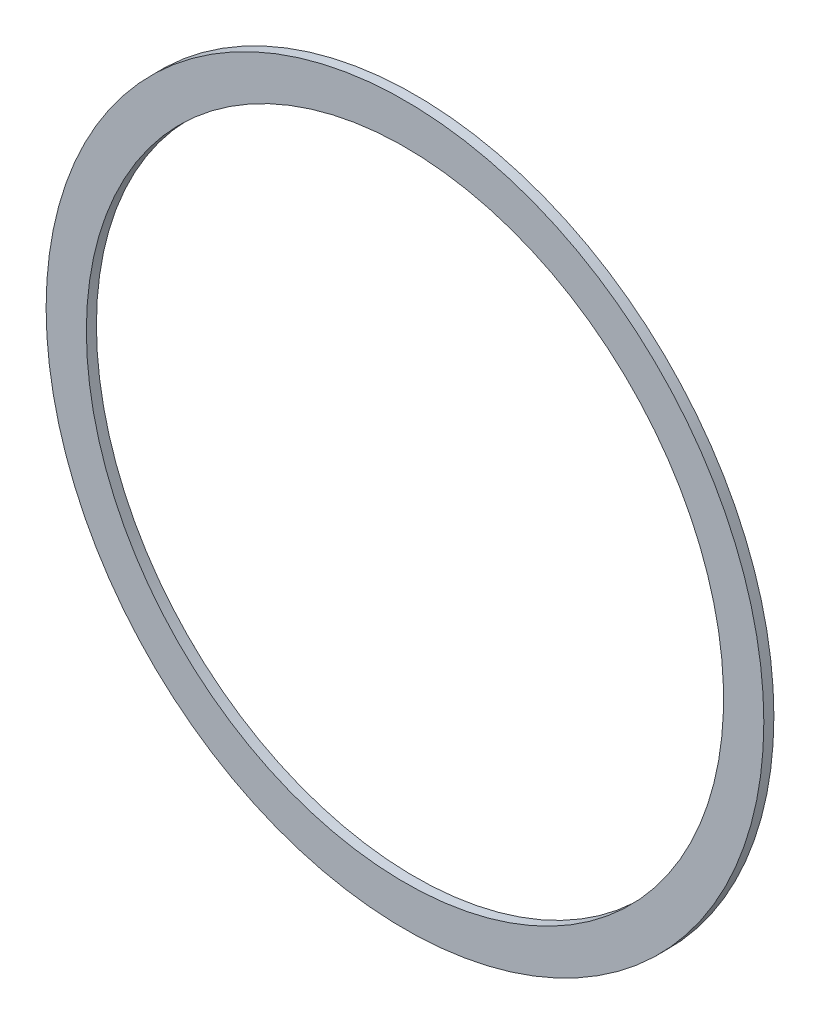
ISO-10303-21;
HEADER;
FILE_DESCRIPTION(('STEP AP214'),'2;1');
FILE_NAME('part.step','',(''),(''),'','','');
FILE_SCHEMA(('AUTOMOTIVE_DESIGN { 1 0 10303 214 1 1 1 1 }'));
ENDSEC;
DATA;
#1=APPLICATION_CONTEXT('core data for automotive mechanical design processes');
#2=APPLICATION_PROTOCOL_DEFINITION('international standard','automotive_design',2000,#1);
#3=PRODUCT_CONTEXT('',#1,'mechanical');
#4=PRODUCT('Part','Part','',(#3));
#5=PRODUCT_RELATED_PRODUCT_CATEGORY('part','',(#4));
#6=PRODUCT_DEFINITION_FORMATION('','',#4);
#7=PRODUCT_DEFINITION_CONTEXT('part definition',#1,'design');
#8=PRODUCT_DEFINITION('design','',#6,#7);
#9=PRODUCT_DEFINITION_SHAPE('','',#8);
#10=(LENGTH_UNIT() NAMED_UNIT(*) SI_UNIT(.MILLI.,.METRE.));
#11=(NAMED_UNIT(*) PLANE_ANGLE_UNIT() SI_UNIT($,.RADIAN.));
#12=(NAMED_UNIT(*) SI_UNIT($,.STERADIAN.) SOLID_ANGLE_UNIT());
#13=UNCERTAINTY_MEASURE_WITH_UNIT(LENGTH_MEASURE(1.E-05),#10,'distance_accuracy_value','');
#14=(GEOMETRIC_REPRESENTATION_CONTEXT(3) GLOBAL_UNCERTAINTY_ASSIGNED_CONTEXT((#13)) GLOBAL_UNIT_ASSIGNED_CONTEXT((#10,
#11,#12)) REPRESENTATION_CONTEXT('',''));
#15=CARTESIAN_POINT('',(0.,0.,0.));
#16=DIRECTION('',(0.,0.,1.));
#17=DIRECTION('',(1.,0.,0.));
#18=AXIS2_PLACEMENT_3D('',#15,#16,#17);
#19=CARTESIAN_POINT('',(0.,0.,0.762));
#20=DIRECTION('',(0.,0.,1.));
#21=DIRECTION('',(1.,0.,0.));
#22=AXIS2_PLACEMENT_3D('',#19,#20,#21);
#23=PLANE('',#22);
#24=CARTESIAN_POINT('',(0.,0.,0.762));
#25=DIRECTION('',(0.,0.,1.));
#26=DIRECTION('',(1.,0.,0.));
#27=AXIS2_PLACEMENT_3D('',#24,#25,#26);
#28=CIRCLE('',#27,27.178);
#29=CARTESIAN_POINT('',(-27.178,0.,0.762));
#30=VERTEX_POINT('',#29);
#31=EDGE_CURVE('E10',#30,#30,#28,.T.);
#32=ORIENTED_EDGE('',*,*,#31,.T.);
#33=EDGE_LOOP('',(#32));
#34=FACE_BOUND('',#33,.T.);
#35=CARTESIAN_POINT('',(0.,0.,0.762));
#36=DIRECTION('',(0.,0.,1.));
#37=DIRECTION('',(1.,0.,0.));
#38=AXIS2_PLACEMENT_3D('',#35,#36,#37);
#39=CIRCLE('',#38,24.13);
#40=CARTESIAN_POINT('',(-24.13,0.,0.762));
#41=VERTEX_POINT('',#40);
#42=EDGE_CURVE('E37',#41,#41,#39,.T.);
#43=ORIENTED_EDGE('',*,*,#42,.F.);
#44=EDGE_LOOP('',(#43));
#45=FACE_BOUND('',#44,.T.);
#46=ADVANCED_FACE('F26',(#34,#45),#23,.T.);
#47=CARTESIAN_POINT('',(0.,0.,0.));
#48=DIRECTION('',(0.,0.,1.));
#49=DIRECTION('',(1.,0.,0.));
#50=AXIS2_PLACEMENT_3D('',#47,#48,#49);
#51=PLANE('',#50);
#52=CARTESIAN_POINT('',(0.,0.,0.));
#53=DIRECTION('',(0.,0.,1.));
#54=DIRECTION('',(1.,0.,0.));
#55=AXIS2_PLACEMENT_3D('',#52,#53,#54);
#56=CIRCLE('',#55,27.178);
#57=CARTESIAN_POINT('',(-27.178,0.,0.));
#58=VERTEX_POINT('',#57);
#59=EDGE_CURVE('E33',#58,#58,#56,.T.);
#60=ORIENTED_EDGE('',*,*,#59,.F.);
#61=EDGE_LOOP('',(#60));
#62=FACE_BOUND('',#61,.T.);
#63=CARTESIAN_POINT('',(0.,0.,0.));
#64=DIRECTION('',(0.,0.,1.));
#65=DIRECTION('',(1.,0.,0.));
#66=AXIS2_PLACEMENT_3D('',#63,#64,#65);
#67=CIRCLE('',#66,24.13);
#68=CARTESIAN_POINT('',(-24.13,0.,0.));
#69=VERTEX_POINT('',#68);
#70=EDGE_CURVE('E41',#69,#69,#67,.T.);
#71=ORIENTED_EDGE('',*,*,#70,.T.);
#72=EDGE_LOOP('',(#71));
#73=FACE_BOUND('',#72,.T.);
#74=ADVANCED_FACE('F47',(#62,#73),#51,.F.);
#75=CARTESIAN_POINT('',(0.,0.,0.762));
#76=DIRECTION('',(0.,0.,-1.));
#77=DIRECTION('',(-1.,0.,0.));
#78=AXIS2_PLACEMENT_3D('',#75,#76,#77);
#79=CYLINDRICAL_SURFACE('',#78,27.178);
#80=CARTESIAN_POINT('',(-27.178,0.,0.762));
#81=CARTESIAN_POINT('',(-27.178,0.,0.7540625));
#82=CARTESIAN_POINT('',(-27.178,0.,0.746125));
#83=CARTESIAN_POINT('',(-27.178,0.,0.73025));
#84=CARTESIAN_POINT('',(-27.178,0.,0.7223125));
#85=CARTESIAN_POINT('',(-27.178,0.,0.7064375));
#86=CARTESIAN_POINT('',(-27.178,0.,0.6985));
#87=CARTESIAN_POINT('',(-27.178,0.,0.682625));
#88=CARTESIAN_POINT('',(-27.178,0.,0.6746875));
#89=CARTESIAN_POINT('',(-27.178,0.,0.6588125));
#90=CARTESIAN_POINT('',(-27.178,0.,0.650875));
#91=CARTESIAN_POINT('',(-27.178,0.,0.635));
#92=CARTESIAN_POINT('',(-27.178,0.,0.6270625));
#93=CARTESIAN_POINT('',(-27.178,0.,0.6111875));
#94=CARTESIAN_POINT('',(-27.178,0.,0.60325));
#95=CARTESIAN_POINT('',(-27.178,0.,0.587375));
#96=CARTESIAN_POINT('',(-27.178,0.,0.5794375));
#97=CARTESIAN_POINT('',(-27.178,0.,0.5635625));
#98=CARTESIAN_POINT('',(-27.178,0.,0.555625));
#99=CARTESIAN_POINT('',(-27.178,0.,0.53975));
#100=CARTESIAN_POINT('',(-27.178,0.,0.5318125));
#101=CARTESIAN_POINT('',(-27.178,0.,0.5159375));
#102=CARTESIAN_POINT('',(-27.178,0.,0.508));
#103=CARTESIAN_POINT('',(-27.178,0.,0.492125));
#104=CARTESIAN_POINT('',(-27.178,0.,0.4841875));
#105=CARTESIAN_POINT('',(-27.178,0.,0.4683125));
#106=CARTESIAN_POINT('',(-27.178,0.,0.460375));
#107=CARTESIAN_POINT('',(-27.178,0.,0.4445));
#108=CARTESIAN_POINT('',(-27.178,0.,0.4365625));
#109=CARTESIAN_POINT('',(-27.178,0.,0.4206875));
#110=CARTESIAN_POINT('',(-27.178,0.,0.41275));
#111=CARTESIAN_POINT('',(-27.178,0.,0.396875));
#112=CARTESIAN_POINT('',(-27.178,0.,0.3889375));
#113=CARTESIAN_POINT('',(-27.178,0.,0.3730625));
#114=CARTESIAN_POINT('',(-27.178,0.,0.365125));
#115=CARTESIAN_POINT('',(-27.178,0.,0.34925));
#116=CARTESIAN_POINT('',(-27.178,0.,0.3413125));
#117=CARTESIAN_POINT('',(-27.178,0.,0.3254375));
#118=CARTESIAN_POINT('',(-27.178,0.,0.3175));
#119=CARTESIAN_POINT('',(-27.178,0.,0.301625));
#120=CARTESIAN_POINT('',(-27.178,0.,0.2936875));
#121=CARTESIAN_POINT('',(-27.178,0.,0.2778125));
#122=CARTESIAN_POINT('',(-27.178,0.,0.269875));
#123=CARTESIAN_POINT('',(-27.178,0.,0.254));
#124=CARTESIAN_POINT('',(-27.178,0.,0.2460625));
#125=CARTESIAN_POINT('',(-27.178,0.,0.2301875));
#126=CARTESIAN_POINT('',(-27.178,0.,0.22225));
#127=CARTESIAN_POINT('',(-27.178,0.,0.206375));
#128=CARTESIAN_POINT('',(-27.178,0.,0.1984375));
#129=CARTESIAN_POINT('',(-27.178,0.,0.1825625));
#130=CARTESIAN_POINT('',(-27.178,0.,0.174625));
#131=CARTESIAN_POINT('',(-27.178,0.,0.15875));
#132=CARTESIAN_POINT('',(-27.178,0.,0.1508125));
#133=CARTESIAN_POINT('',(-27.178,0.,0.1349375));
#134=CARTESIAN_POINT('',(-27.178,0.,0.127));
#135=CARTESIAN_POINT('',(-27.178,0.,0.111125));
#136=CARTESIAN_POINT('',(-27.178,0.,0.1031875));
#137=CARTESIAN_POINT('',(-27.178,0.,0.0873125));
#138=CARTESIAN_POINT('',(-27.178,0.,0.079375));
#139=CARTESIAN_POINT('',(-27.178,0.,0.0635));
#140=CARTESIAN_POINT('',(-27.178,0.,0.0555625));
#141=CARTESIAN_POINT('',(-27.178,0.,0.0396875));
#142=CARTESIAN_POINT('',(-27.178,0.,0.03175));
#143=CARTESIAN_POINT('',(-27.178,0.,0.015875));
#144=CARTESIAN_POINT('',(-27.178,0.,0.00793749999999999));
#145=CARTESIAN_POINT('',(-27.178,0.,0.));
#146=B_SPLINE_CURVE_WITH_KNOTS('',3,(#80,#81,#82,#83,#84,#85,#86,#87,#88,#89,#90,#91,#92,#93,
#94,#95,#96,#97,#98,#99,#100,#101,#102,#103,#104,#105,#106,#107,#108,#109,#110,#111,#112,#113,
#114,#115,#116,#117,#118,#119,#120,#121,#122,#123,#124,#125,#126,#127,#128,#129,#130,#131,#132,
#133,#134,#135,#136,#137,#138,#139,#140,#141,#142,#143,#144,#145),.UNSPECIFIED.,.F.,.F.,(4,2,2,
2,2,2,2,2,2,2,2,2,2,2,2,2,2,2,2,2,2,2,2,2,2,2,2,2,2,2,2,2,4),(0.,0.0238125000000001,0.047625,
0.0714375,0.0952500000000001,0.1190625,0.142875,0.1666875,0.1905,0.2143125,0.238125,0.2619375,
0.28575,0.3095625,0.333375,0.3571875,0.381,0.4048125,0.428625,0.4524375,0.47625,0.5000625,
0.523875,0.5476875,0.5715,0.5953125,0.619125,0.6429375,0.66675,0.6905625,0.714375,0.7381875,
0.762),.UNSPECIFIED.);
#147=EDGE_CURVE('BSEAM28',#30,#58,#146,.T.);
#148=ORIENTED_EDGE('',*,*,#31,.F.);
#149=ORIENTED_EDGE('',*,*,#59,.T.);
#150=ORIENTED_EDGE('',*,*,#147,.T.);
#151=ORIENTED_EDGE('',*,*,#147,.F.);
#152=EDGE_LOOP('',(#148,#150,#149,#151));
#153=FACE_BOUND('',#152,.T.);
#154=ADVANCED_FACE('F28',(#153),#79,.T.);
#155=CARTESIAN_POINT('',(0.,0.,0.762));
#156=DIRECTION('',(0.,0.,-1.));
#157=DIRECTION('',(-1.,0.,0.));
#158=AXIS2_PLACEMENT_3D('',#155,#156,#157);
#159=CYLINDRICAL_SURFACE('',#158,24.13);
#160=CARTESIAN_POINT('',(-24.13,0.,0.762));
#161=CARTESIAN_POINT('',(-24.13,0.,0.7540625));
#162=CARTESIAN_POINT('',(-24.13,0.,0.746125));
#163=CARTESIAN_POINT('',(-24.13,0.,0.73025));
#164=CARTESIAN_POINT('',(-24.13,0.,0.7223125));
#165=CARTESIAN_POINT('',(-24.13,0.,0.7064375));
#166=CARTESIAN_POINT('',(-24.13,0.,0.6985));
#167=CARTESIAN_POINT('',(-24.13,0.,0.682625));
#168=CARTESIAN_POINT('',(-24.13,0.,0.6746875));
#169=CARTESIAN_POINT('',(-24.13,0.,0.6588125));
#170=CARTESIAN_POINT('',(-24.13,0.,0.650875));
#171=CARTESIAN_POINT('',(-24.13,0.,0.635));
#172=CARTESIAN_POINT('',(-24.13,0.,0.6270625));
#173=CARTESIAN_POINT('',(-24.13,0.,0.6111875));
#174=CARTESIAN_POINT('',(-24.13,0.,0.60325));
#175=CARTESIAN_POINT('',(-24.13,0.,0.587375));
#176=CARTESIAN_POINT('',(-24.13,0.,0.5794375));
#177=CARTESIAN_POINT('',(-24.13,0.,0.5635625));
#178=CARTESIAN_POINT('',(-24.13,0.,0.555625));
#179=CARTESIAN_POINT('',(-24.13,0.,0.53975));
#180=CARTESIAN_POINT('',(-24.13,0.,0.5318125));
#181=CARTESIAN_POINT('',(-24.13,0.,0.5159375));
#182=CARTESIAN_POINT('',(-24.13,0.,0.508));
#183=CARTESIAN_POINT('',(-24.13,0.,0.492125));
#184=CARTESIAN_POINT('',(-24.13,0.,0.4841875));
#185=CARTESIAN_POINT('',(-24.13,0.,0.4683125));
#186=CARTESIAN_POINT('',(-24.13,0.,0.460375));
#187=CARTESIAN_POINT('',(-24.13,0.,0.4445));
#188=CARTESIAN_POINT('',(-24.13,0.,0.4365625));
#189=CARTESIAN_POINT('',(-24.13,0.,0.4206875));
#190=CARTESIAN_POINT('',(-24.13,0.,0.41275));
#191=CARTESIAN_POINT('',(-24.13,0.,0.396875));
#192=CARTESIAN_POINT('',(-24.13,0.,0.3889375));
#193=CARTESIAN_POINT('',(-24.13,0.,0.3730625));
#194=CARTESIAN_POINT('',(-24.13,0.,0.365125));
#195=CARTESIAN_POINT('',(-24.13,0.,0.34925));
#196=CARTESIAN_POINT('',(-24.13,0.,0.3413125));
#197=CARTESIAN_POINT('',(-24.13,0.,0.3254375));
#198=CARTESIAN_POINT('',(-24.13,0.,0.3175));
#199=CARTESIAN_POINT('',(-24.13,0.,0.301625));
#200=CARTESIAN_POINT('',(-24.13,0.,0.2936875));
#201=CARTESIAN_POINT('',(-24.13,0.,0.2778125));
#202=CARTESIAN_POINT('',(-24.13,0.,0.269875));
#203=CARTESIAN_POINT('',(-24.13,0.,0.254));
#204=CARTESIAN_POINT('',(-24.13,0.,0.2460625));
#205=CARTESIAN_POINT('',(-24.13,0.,0.2301875));
#206=CARTESIAN_POINT('',(-24.13,0.,0.22225));
#207=CARTESIAN_POINT('',(-24.13,0.,0.206375));
#208=CARTESIAN_POINT('',(-24.13,0.,0.1984375));
#209=CARTESIAN_POINT('',(-24.13,0.,0.1825625));
#210=CARTESIAN_POINT('',(-24.13,0.,0.174625));
#211=CARTESIAN_POINT('',(-24.13,0.,0.15875));
#212=CARTESIAN_POINT('',(-24.13,0.,0.1508125));
#213=CARTESIAN_POINT('',(-24.13,0.,0.1349375));
#214=CARTESIAN_POINT('',(-24.13,0.,0.127));
#215=CARTESIAN_POINT('',(-24.13,0.,0.111125));
#216=CARTESIAN_POINT('',(-24.13,0.,0.1031875));
#217=CARTESIAN_POINT('',(-24.13,0.,0.0873125));
#218=CARTESIAN_POINT('',(-24.13,0.,0.079375));
#219=CARTESIAN_POINT('',(-24.13,0.,0.0635));
#220=CARTESIAN_POINT('',(-24.13,0.,0.0555625));
#221=CARTESIAN_POINT('',(-24.13,0.,0.0396875));
#222=CARTESIAN_POINT('',(-24.13,0.,0.03175));
#223=CARTESIAN_POINT('',(-24.13,0.,0.015875));
#224=CARTESIAN_POINT('',(-24.13,0.,0.00793749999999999));
#225=CARTESIAN_POINT('',(-24.13,0.,0.));
#226=B_SPLINE_CURVE_WITH_KNOTS('',3,(#160,#161,#162,#163,#164,#165,#166,#167,#168,#169,#170,
#171,#172,#173,#174,#175,#176,#177,#178,#179,#180,#181,#182,#183,#184,#185,#186,#187,#188,#189,
#190,#191,#192,#193,#194,#195,#196,#197,#198,#199,#200,#201,#202,#203,#204,#205,#206,#207,#208,
#209,#210,#211,#212,#213,#214,#215,#216,#217,#218,#219,#220,#221,#222,#223,#224,#225),
.UNSPECIFIED.,.F.,.F.,(4,2,2,2,2,2,2,2,2,2,2,2,2,2,2,2,2,2,2,2,2,2,2,2,2,2,2,2,2,2,2,2,4),(0.,
0.0238125,0.0476249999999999,0.0714374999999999,0.09525,0.1190625,0.142875,0.1666875,0.1905,
0.2143125,0.238125,0.2619375,0.28575,0.3095625,0.333375,0.3571875,0.381,0.4048125,0.428625,
0.4524375,0.47625,0.5000625,0.523875,0.5476875,0.5715,0.5953125,0.619125,0.6429375,0.66675,
0.6905625,0.714375,0.7381875,0.762),.UNSPECIFIED.);
#227=EDGE_CURVE('BSEAM49',#41,#69,#226,.T.);
#228=ORIENTED_EDGE('',*,*,#42,.T.);
#229=ORIENTED_EDGE('',*,*,#70,.F.);
#230=ORIENTED_EDGE('',*,*,#227,.T.);
#231=ORIENTED_EDGE('',*,*,#227,.F.);
#232=EDGE_LOOP('',(#228,#230,#229,#231));
#233=FACE_BOUND('',#232,.T.);
#234=ADVANCED_FACE('F49',(#233),#159,.F.);
#235=CLOSED_SHELL('',(#46,#74,#154,#234));
#236=MANIFOLD_SOLID_BREP('B2',#235);
#237=ADVANCED_BREP_SHAPE_REPRESENTATION('',(#18,#236),#14);
#238=SHAPE_DEFINITION_REPRESENTATION(#9,#237);
ENDSEC;
END-ISO-10303-21;
